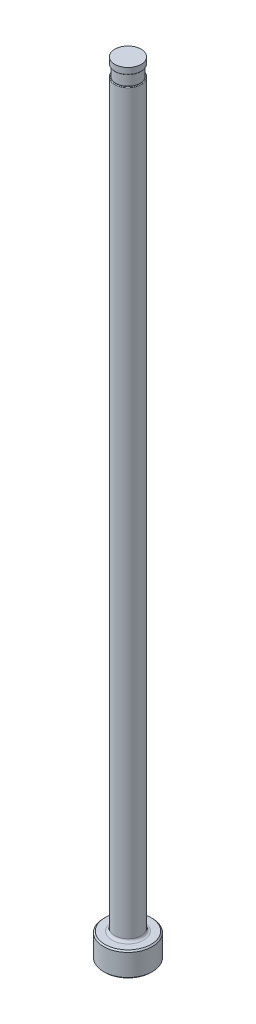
ISO-10303-21;
HEADER;
FILE_DESCRIPTION(('STEP AP214'),'2;1');
FILE_NAME('part.step','',(''),(''),'','','');
FILE_SCHEMA(('AUTOMOTIVE_DESIGN { 1 0 10303 214 1 1 1 1 }'));
ENDSEC;
DATA;
#1=APPLICATION_CONTEXT('core data for automotive mechanical design processes');
#2=APPLICATION_PROTOCOL_DEFINITION('international standard','automotive_design',2000,#1);
#3=PRODUCT_CONTEXT('',#1,'mechanical');
#4=PRODUCT('Part','Part','',(#3));
#5=PRODUCT_RELATED_PRODUCT_CATEGORY('part','',(#4));
#6=PRODUCT_DEFINITION_FORMATION('','',#4);
#7=PRODUCT_DEFINITION_CONTEXT('part definition',#1,'design');
#8=PRODUCT_DEFINITION('design','',#6,#7);
#9=PRODUCT_DEFINITION_SHAPE('','',#8);
#10=(LENGTH_UNIT() NAMED_UNIT(*) SI_UNIT(.MILLI.,.METRE.));
#11=(NAMED_UNIT(*) PLANE_ANGLE_UNIT() SI_UNIT($,.RADIAN.));
#12=(NAMED_UNIT(*) SI_UNIT($,.STERADIAN.) SOLID_ANGLE_UNIT());
#13=UNCERTAINTY_MEASURE_WITH_UNIT(LENGTH_MEASURE(1.E-05),#10,'distance_accuracy_value','');
#14=(GEOMETRIC_REPRESENTATION_CONTEXT(3) GLOBAL_UNCERTAINTY_ASSIGNED_CONTEXT((#13)) GLOBAL_UNIT_ASSIGNED_CONTEXT((#10,
#11,#12)) REPRESENTATION_CONTEXT('',''));
#15=CARTESIAN_POINT('',(0.,0.,0.));
#16=DIRECTION('',(0.,0.,1.));
#17=DIRECTION('',(1.,0.,0.));
#18=AXIS2_PLACEMENT_3D('',#15,#16,#17);
#19=CARTESIAN_POINT('',(-2.57936999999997,151.13,0.));
#20=DIRECTION('',(0.,1.,0.));
#21=DIRECTION('',(0.,0.,1.));
#22=AXIS2_PLACEMENT_3D('',#19,#20,#21);
#23=PLANE('',#22);
#24=CARTESIAN_POINT('',(0.,151.13,0.));
#25=DIRECTION('',(0.,1.,0.));
#26=DIRECTION('',(0.,0.,1.));
#27=AXIS2_PLACEMENT_3D('',#24,#25,#26);
#28=CIRCLE('',#27,2.43966999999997);
#29=CARTESIAN_POINT('',(0.,151.13,2.43966999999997));
#30=VERTEX_POINT('',#29);
#31=EDGE_CURVE('E11',#30,#30,#28,.F.);
#32=ORIENTED_EDGE('',*,*,#31,.T.);
#33=EDGE_LOOP('',(#32));
#34=FACE_BOUND('',#33,.T.);
#35=CARTESIAN_POINT('',(0.,151.13,0.));
#36=DIRECTION('',(0.,1.,0.));
#37=DIRECTION('',(0.,0.,1.));
#38=AXIS2_PLACEMENT_3D('',#35,#36,#37);
#39=CIRCLE('',#38,2.37616999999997);
#40=CARTESIAN_POINT('',(0.,151.13,2.37616999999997));
#41=VERTEX_POINT('',#40);
#42=EDGE_CURVE('E78',#41,#41,#39,.T.);
#43=ORIENTED_EDGE('',*,*,#42,.T.);
#44=EDGE_LOOP('',(#43));
#45=FACE_BOUND('',#44,.T.);
#46=ADVANCED_FACE('F36',(#34,#45),#23,.F.);
#47=CARTESIAN_POINT('',(0.,259.958771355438,0.));
#48=DIRECTION('',(0.,1.,0.));
#49=DIRECTION('',(0.,0.,1.));
#50=AXIS2_PLACEMENT_3D('',#47,#48,#49);
#51=CYLINDRICAL_SURFACE('',#50,2.57936999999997);
#52=DIRECTION('',(0.,1.,0.));
#53=VECTOR('',#52,1.);
#54=CARTESIAN_POINT('',(-2.37616999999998,259.958771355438,-1.00347681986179));
#55=LINE('',#54,#53);
#56=CARTESIAN_POINT('',(-2.37616999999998,148.971,-1.00347681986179));
#57=VERTEX_POINT('',#56);
#58=CARTESIAN_POINT('',(-2.37616999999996,86.614,-1.00347681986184));
#59=VERTEX_POINT('',#58);
#60=EDGE_CURVE('E73',#57,#59,#55,.F.);
#61=ORIENTED_EDGE('',*,*,#60,.F.);
#62=CARTESIAN_POINT('',(0.,148.971,0.));
#63=DIRECTION('',(0.,-1.,0.));
#64=DIRECTION('',(0.,0.,-1.));
#65=AXIS2_PLACEMENT_3D('',#62,#63,#64);
#66=CIRCLE('',#65,2.57936999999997);
#67=CARTESIAN_POINT('',(-2.37616999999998,148.971,1.00347681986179));
#68=VERTEX_POINT('',#67);
#69=EDGE_CURVE('E51',#57,#68,#66,.T.);
#70=ORIENTED_EDGE('',*,*,#69,.T.);
#71=DIRECTION('',(0.,1.,0.));
#72=VECTOR('',#71,1.);
#73=CARTESIAN_POINT('',(-2.37616999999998,259.958771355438,1.00347681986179));
#74=LINE('',#73,#72);
#75=CARTESIAN_POINT('',(-2.37616999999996,86.614,1.00347681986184));
#76=VERTEX_POINT('',#75);
#77=EDGE_CURVE('E84',#76,#68,#74,.T.);
#78=ORIENTED_EDGE('',*,*,#77,.F.);
#79=CARTESIAN_POINT('',(-2.37616999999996,86.614,-1.00347681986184));
#80=CARTESIAN_POINT('',(-2.3761678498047,86.5806535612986,-1.00347324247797));
#81=CARTESIAN_POINT('',(-2.37669600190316,86.547321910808,-1.00223238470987));
#82=CARTESIAN_POINT('',(-2.37878830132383,86.4808712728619,-0.997259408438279));
#83=CARTESIAN_POINT('',(-2.3803526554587,86.4477523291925,-0.993526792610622));
#84=CARTESIAN_POINT('',(-2.38657174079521,86.348866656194,-0.97854537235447));
#85=CARTESIAN_POINT('',(-2.39275229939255,86.2837173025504,-0.963512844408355));
#86=CARTESIAN_POINT('',(-2.40858326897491,86.1569814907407,-0.923223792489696));
#87=CARTESIAN_POINT('',(-2.41823988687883,86.0954016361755,-0.897948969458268));
#88=CARTESIAN_POINT('',(-2.4399460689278,85.9780247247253,-0.837167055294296));
#89=CARTESIAN_POINT('',(-2.45199238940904,85.9222199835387,-0.801673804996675));
#90=CARTESIAN_POINT('',(-2.47634550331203,85.8211237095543,-0.722822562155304));
#91=CARTESIAN_POINT('',(-2.48860868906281,85.7754444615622,-0.679950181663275));
#92=CARTESIAN_POINT('',(-2.51236371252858,85.6930631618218,-0.586096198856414));
#93=CARTESIAN_POINT('',(-2.52385591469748,85.6563568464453,-0.53511846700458));
#94=CARTESIAN_POINT('',(-2.54336333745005,85.5968448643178,-0.432311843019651));
#95=CARTESIAN_POINT('',(-2.55161740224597,85.5729816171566,-0.381139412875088));
#96=CARTESIAN_POINT('',(-2.56521925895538,85.5345821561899,-0.275047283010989));
#97=CARTESIAN_POINT('',(-2.5705685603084,85.5200410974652,-0.220129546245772));
#98=CARTESIAN_POINT('',(-2.57742936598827,85.5015339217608,-0.112636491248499));
#99=CARTESIAN_POINT('',(-2.57920175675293,85.4968477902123,-0.0602005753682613));
#100=CARTESIAN_POINT('',(-2.57951508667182,85.496013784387,0.0447435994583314));
#101=CARTESIAN_POINT('',(-2.57805674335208,85.4998640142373,0.0972518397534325));
#102=CARTESIAN_POINT('',(-2.57214487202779,85.515773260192,0.199435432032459));
#103=CARTESIAN_POINT('',(-2.56776943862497,85.5276183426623,0.249148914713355));
#104=CARTESIAN_POINT('',(-2.55654798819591,85.5589461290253,0.345804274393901));
#105=CARTESIAN_POINT('',(-2.54970197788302,85.5784288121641,0.392746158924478));
#106=CARTESIAN_POINT('',(-2.53407309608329,85.62487953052,0.483513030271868));
#107=CARTESIAN_POINT('',(-2.52525719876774,85.6519775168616,0.527265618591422));
#108=CARTESIAN_POINT('',(-2.5066235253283,85.7126856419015,0.609736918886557));
#109=CARTESIAN_POINT('',(-2.49680555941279,85.7462970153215,0.648454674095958));
#110=CARTESIAN_POINT('',(-2.47647062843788,85.8212568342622,0.722358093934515));
#111=CARTESIAN_POINT('',(-2.46594700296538,85.8629479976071,0.757193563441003));
#112=CARTESIAN_POINT('',(-2.44575759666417,85.951357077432,0.820068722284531));
#113=CARTESIAN_POINT('',(-2.43609222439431,85.9980773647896,0.848105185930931));
#114=CARTESIAN_POINT('',(-2.41760539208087,86.0998831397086,0.899528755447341));
#115=CARTESIAN_POINT('',(-2.40894797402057,86.1553422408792,0.922233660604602));
#116=CARTESIAN_POINT('',(-2.39441308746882,86.269312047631,0.959340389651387));
#117=CARTESIAN_POINT('',(-2.3885356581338,86.3278227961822,0.973742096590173));
#118=CARTESIAN_POINT('',(-2.38160417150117,86.4245543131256,0.990534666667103));
#119=CARTESIAN_POINT('',(-2.37957064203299,86.4622987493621,0.995396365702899));
#120=CARTESIAN_POINT('',(-2.37685226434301,86.5380255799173,1.00186164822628));
#121=CARTESIAN_POINT('',(-2.3761642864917,86.5760072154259,1.00347279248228));
#122=CARTESIAN_POINT('',(-2.37616999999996,86.614,1.00347681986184));
#123=B_SPLINE_CURVE_WITH_KNOTS('',3,(#79,#80,#81,#82,#83,#84,#85,#86,#87,#88,#89,#90,#91,#92,
#93,#94,#95,#96,#97,#98,#99,#100,#101,#102,#103,#104,#105,#106,#107,#108,#109,#110,#111,#112,
#113,#114,#115,#116,#117,#118,#119,#120,#121,#122),.UNSPECIFIED.,.F.,.F.,(4,2,2,2,2,2,2,2,2,2,2,
2,2,2,2,2,2,2,2,2,2,4),(0.,0.099982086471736,0.199984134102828,0.400421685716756,
0.601218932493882,0.80174546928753,0.992181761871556,1.18252738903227,1.35280353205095,
1.52299110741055,1.68023815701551,1.83745028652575,1.99061412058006,2.14377753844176,
2.29973239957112,2.45571685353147,2.62103910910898,2.78643964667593,2.96734496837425,
3.14825283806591,3.26243374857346,3.37634876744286),.UNSPECIFIED.);
#124=EDGE_CURVE('E81',#59,#76,#123,.T.);
#125=ORIENTED_EDGE('',*,*,#124,.F.);
#126=EDGE_LOOP('',(#61,#70,#78,#125));
#127=FACE_BOUND('',#126,.T.);
#128=CARTESIAN_POINT('',(0.,5.25779999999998,0.));
#129=DIRECTION('',(0.,1.,0.));
#130=DIRECTION('',(0.,0.,1.));
#131=AXIS2_PLACEMENT_3D('',#128,#129,#130);
#132=CIRCLE('',#131,2.57936999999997);
#133=CARTESIAN_POINT('',(0.,5.25779999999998,2.57936999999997));
#134=VERTEX_POINT('',#133);
#135=EDGE_CURVE('E116',#134,#134,#132,.T.);
#136=ORIENTED_EDGE('',*,*,#135,.T.);
#137=EDGE_LOOP('',(#136));
#138=FACE_BOUND('',#137,.T.);
#139=ADVANCED_FACE('F82',(#127,#138),#51,.T.);
#140=CARTESIAN_POINT('',(0.,0.,0.));
#141=DIRECTION('',(0.,-1.,0.));
#142=DIRECTION('',(0.,0.,-1.));
#143=AXIS2_PLACEMENT_3D('',#140,#141,#142);
#144=PLANE('',#143);
#145=CARTESIAN_POINT('',(0.,0.,0.));
#146=DIRECTION('',(0.,-1.,0.));
#147=DIRECTION('',(0.,0.,-1.));
#148=AXIS2_PLACEMENT_3D('',#145,#146,#147);
#149=CIRCLE('',#148,4.50849999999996);
#150=CARTESIAN_POINT('',(0.,0.,-4.50849999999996));
#151=VERTEX_POINT('',#150);
#152=EDGE_CURVE('E113',#151,#151,#149,.T.);
#153=ORIENTED_EDGE('',*,*,#152,.T.);
#154=EDGE_LOOP('',(#153));
#155=FACE_BOUND('',#154,.T.);
#156=ADVANCED_FACE('F192',(#155),#144,.T.);
#157=CARTESIAN_POINT('',(0.,259.958771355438,0.));
#158=DIRECTION('',(0.,1.,0.));
#159=DIRECTION('',(0.,0.,1.));
#160=AXIS2_PLACEMENT_3D('',#157,#158,#159);
#161=CYLINDRICAL_SURFACE('',#160,4.76249999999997);
#162=CARTESIAN_POINT('',(0.,4.49579999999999,0.));
#163=DIRECTION('',(0.,1.,0.));
#164=DIRECTION('',(0.,0.,1.));
#165=AXIS2_PLACEMENT_3D('',#162,#163,#164);
#166=CIRCLE('',#165,4.76249999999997);
#167=CARTESIAN_POINT('',(0.,4.49579999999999,4.76249999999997));
#168=VERTEX_POINT('',#167);
#169=EDGE_CURVE('E110',#168,#168,#166,.F.);
#170=ORIENTED_EDGE('',*,*,#169,.T.);
#171=EDGE_LOOP('',(#170));
#172=FACE_BOUND('',#171,.T.);
#173=CARTESIAN_POINT('',(0.,0.254000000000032,0.));
#174=DIRECTION('',(0.,-1.,0.));
#175=DIRECTION('',(0.,0.,-1.));
#176=AXIS2_PLACEMENT_3D('',#173,#174,#175);
#177=CIRCLE('',#176,4.76249999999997);
#178=CARTESIAN_POINT('',(0.,0.254000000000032,-4.76249999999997));
#179=VERTEX_POINT('',#178);
#180=EDGE_CURVE('E107',#179,#179,#177,.F.);
#181=ORIENTED_EDGE('',*,*,#180,.T.);
#182=EDGE_LOOP('',(#181));
#183=FACE_BOUND('',#182,.T.);
#184=ADVANCED_FACE('F195',(#172,#183),#161,.T.);
#185=CARTESIAN_POINT('',(-4.76249999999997,4.7498,0.));
#186=DIRECTION('',(0.,1.,0.));
#187=DIRECTION('',(0.,0.,1.));
#188=AXIS2_PLACEMENT_3D('',#185,#186,#187);
#189=PLANE('',#188);
#190=CARTESIAN_POINT('',(0.,4.7498,0.));
#191=DIRECTION('',(0.,1.,0.));
#192=DIRECTION('',(0.,0.,1.));
#193=AXIS2_PLACEMENT_3D('',#190,#191,#192);
#194=CIRCLE('',#193,3.08736999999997);
#195=CARTESIAN_POINT('',(0.,4.7498,3.08736999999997));
#196=VERTEX_POINT('',#195);
#197=EDGE_CURVE('E87',#196,#196,#194,.F.);
#198=ORIENTED_EDGE('',*,*,#197,.T.);
#199=EDGE_LOOP('',(#198));
#200=FACE_BOUND('',#199,.T.);
#201=CARTESIAN_POINT('',(0.,4.7498,0.));
#202=DIRECTION('',(0.,1.,0.));
#203=DIRECTION('',(0.,0.,1.));
#204=AXIS2_PLACEMENT_3D('',#201,#202,#203);
#205=CIRCLE('',#204,4.50849999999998);
#206=CARTESIAN_POINT('',(0.,4.7498,4.50849999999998));
#207=VERTEX_POINT('',#206);
#208=EDGE_CURVE('E104',#207,#207,#205,.T.);
#209=ORIENTED_EDGE('',*,*,#208,.T.);
#210=EDGE_LOOP('',(#209));
#211=FACE_BOUND('',#210,.T.);
#212=ADVANCED_FACE('F190',(#200,#211),#189,.T.);
#213=CARTESIAN_POINT('',(0.,4.74980000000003,0.));
#214=DIRECTION('',(0.,-1.,0.));
#215=DIRECTION('',(0.,0.,-1.));
#216=AXIS2_PLACEMENT_3D('',#213,#214,#215);
#217=CONICAL_SURFACE('',#216,4.50849999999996,0.785398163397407);
#218=ORIENTED_EDGE('',*,*,#169,.F.);
#219=EDGE_LOOP('',(#218));
#220=FACE_BOUND('',#219,.T.);
#221=ORIENTED_EDGE('',*,*,#208,.F.);
#222=EDGE_LOOP('',(#221));
#223=FACE_BOUND('',#222,.T.);
#224=ADVANCED_FACE('F186',(#220,#223),#217,.T.);
#225=CARTESIAN_POINT('',(0.,0.254000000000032,0.));
#226=DIRECTION('',(0.,1.,0.));
#227=DIRECTION('',(0.,0.,1.));
#228=AXIS2_PLACEMENT_3D('',#225,#226,#227);
#229=CONICAL_SURFACE('',#228,4.76249999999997,0.785398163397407);
#230=ORIENTED_EDGE('',*,*,#152,.F.);
#231=EDGE_LOOP('',(#230));
#232=FACE_BOUND('',#231,.T.);
#233=ORIENTED_EDGE('',*,*,#180,.F.);
#234=EDGE_LOOP('',(#233));
#235=FACE_BOUND('',#234,.T.);
#236=ADVANCED_FACE('F182',(#232,#235),#229,.T.);
#237=CARTESIAN_POINT('',(0.,5.25779999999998,0.));
#238=DIRECTION('',(0.,1.,0.));
#239=DIRECTION('',(0.,0.,1.));
#240=AXIS2_PLACEMENT_3D('',#237,#238,#239);
#241=TOROIDAL_SURFACE('',#240,3.08736999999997,0.508);
#242=ORIENTED_EDGE('',*,*,#197,.F.);
#243=EDGE_LOOP('',(#242));
#244=FACE_BOUND('',#243,.T.);
#245=ORIENTED_EDGE('',*,*,#135,.F.);
#246=EDGE_LOOP('',(#245));
#247=FACE_BOUND('',#246,.T.);
#248=ADVANCED_FACE('F147',(#244,#247),#241,.F.);
#249=CARTESIAN_POINT('',(-2.57936999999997,149.098,0.));
#250=DIRECTION('',(0.,-1.,0.));
#251=DIRECTION('',(0.,0.,-1.));
#252=AXIS2_PLACEMENT_3D('',#249,#250,#251);
#253=PLANE('',#252);
#254=DIRECTION('',(0.,0.,1.));
#255=VECTOR('',#254,1.);
#256=CARTESIAN_POINT('',(-2.37616999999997,149.098,0.));
#257=LINE('',#256,#255);
#258=CARTESIAN_POINT('',(-2.37616999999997,149.098,0.));
#259=VERTEX_POINT('',#258);
#260=CARTESIAN_POINT('',(-2.37616999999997,149.098,0.60657625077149));
#261=VERTEX_POINT('',#260);
#262=EDGE_CURVE('E90',#259,#261,#257,.T.);
#263=ORIENTED_EDGE('',*,*,#262,.T.);
#264=CARTESIAN_POINT('',(0.,149.098,0.));
#265=DIRECTION('',(0.,-1.,0.));
#266=DIRECTION('',(0.,0.,-1.));
#267=AXIS2_PLACEMENT_3D('',#264,#265,#266);
#268=CIRCLE('',#267,2.45236999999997);
#269=CARTESIAN_POINT('',(-2.37616999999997,149.098,-0.60657625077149));
#270=VERTEX_POINT('',#269);
#271=EDGE_CURVE('E86',#261,#270,#268,.F.);
#272=ORIENTED_EDGE('',*,*,#271,.T.);
#273=EDGE_CURVE('E79',#270,#259,#257,.T.);
#274=ORIENTED_EDGE('',*,*,#273,.T.);
#275=CARTESIAN_POINT('',(0.,149.098,0.));
#276=DIRECTION('',(0.,1.,0.));
#277=DIRECTION('',(0.,0.,1.));
#278=AXIS2_PLACEMENT_3D('',#275,#276,#277);
#279=CIRCLE('',#278,2.37616999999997);
#280=EDGE_CURVE('E101',#259,#259,#279,.T.);
#281=ORIENTED_EDGE('',*,*,#280,.F.);
#282=EDGE_LOOP('',(#263,#272,#274,#281));
#283=FACE_BOUND('',#282,.T.);
#284=ADVANCED_FACE('F144',(#283),#253,.F.);
#285=CARTESIAN_POINT('',(0.,153.448281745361,0.));
#286=DIRECTION('',(0.,1.,0.));
#287=DIRECTION('',(0.,0.,1.));
#288=AXIS2_PLACEMENT_3D('',#285,#286,#287);
#289=CYLINDRICAL_SURFACE('',#288,2.37616999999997);
#290=ORIENTED_EDGE('',*,*,#42,.F.);
#291=EDGE_LOOP('',(#290));
#292=FACE_BOUND('',#291,.T.);
#293=ORIENTED_EDGE('',*,*,#280,.T.);
#294=EDGE_LOOP('',(#293));
#295=FACE_BOUND('',#294,.T.);
#296=ADVANCED_FACE('F141',(#292,#295),#289,.T.);
#297=CARTESIAN_POINT('',(-2.37616999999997,150.114,-4.76249999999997));
#298=DIRECTION('',(1.,0.,0.));
#299=DIRECTION('',(0.,1.,0.));
#300=AXIS2_PLACEMENT_3D('',#297,#298,#299);
#301=PLANE('',#300);
#302=ORIENTED_EDGE('',*,*,#273,.F.);
#303=CARTESIAN_POINT('',(-2.37616999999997,149.098,-0.60657625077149));
#304=CARTESIAN_POINT('',(-2.37616999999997,149.097986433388,-0.627774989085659));
#305=CARTESIAN_POINT('',(-2.37616999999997,149.097673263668,-0.648986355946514));
#306=CARTESIAN_POINT('',(-2.37616999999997,149.096169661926,-0.691484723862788));
#307=CARTESIAN_POINT('',(-2.37616999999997,149.094974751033,-0.712771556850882));
#308=CARTESIAN_POINT('',(-2.37616999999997,149.091417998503,-0.755326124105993));
#309=CARTESIAN_POINT('',(-2.37616999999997,149.089052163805,-0.776593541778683));
#310=CARTESIAN_POINT('',(-2.37616999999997,149.082718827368,-0.818863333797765));
#311=CARTESIAN_POINT('',(-2.37616999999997,149.078755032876,-0.839866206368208));
#312=CARTESIAN_POINT('',(-2.37616999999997,149.071365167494,-0.869601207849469));
#313=CARTESIAN_POINT('',(-2.37616999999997,149.068897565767,-0.878570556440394));
#314=CARTESIAN_POINT('',(-2.37616999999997,149.063395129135,-0.896363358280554));
#315=CARTESIAN_POINT('',(-2.37616999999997,149.060358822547,-0.905186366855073));
#316=CARTESIAN_POINT('',(-2.37616999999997,149.053046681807,-0.923923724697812));
#317=CARTESIAN_POINT('',(-2.37616999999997,149.048651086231,-0.933791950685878));
#318=CARTESIAN_POINT('',(-2.37616999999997,149.038570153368,-0.952838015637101));
#319=CARTESIAN_POINT('',(-2.37616999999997,149.032891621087,-0.962019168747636));
#320=CARTESIAN_POINT('',(-2.37616999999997,149.023665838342,-0.973806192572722));
#321=CARTESIAN_POINT('',(-2.37616999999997,149.020910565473,-0.977026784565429));
#322=CARTESIAN_POINT('',(-2.37616999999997,149.015048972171,-0.983149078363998));
#323=CARTESIAN_POINT('',(-2.37616999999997,149.011942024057,-0.986050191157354));
#324=CARTESIAN_POINT('',(-2.37616999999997,149.005290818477,-0.991423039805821));
#325=CARTESIAN_POINT('',(-2.37616999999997,149.001740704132,-0.993887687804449));
#326=CARTESIAN_POINT('',(-2.37616999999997,148.994248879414,-0.998099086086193));
#327=CARTESIAN_POINT('',(-2.37616999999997,148.9903097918,-0.999850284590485));
#328=CARTESIAN_POINT('',(-2.37616999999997,148.983771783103,-1.00188288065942));
#329=CARTESIAN_POINT('',(-2.37616999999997,148.981268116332,-1.00247204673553));
#330=CARTESIAN_POINT('',(-2.37616999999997,148.976178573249,-1.00327288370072));
#331=CARTESIAN_POINT('',(-2.37616999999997,148.973592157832,-1.00348108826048));
#332=CARTESIAN_POINT('',(-2.37616999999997,148.971,-1.00347681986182));
#333=B_SPLINE_CURVE_WITH_KNOTS('',3,(#303,#304,#305,#306,#307,#308,#309,#310,#311,#312,#313,
#314,#315,#316,#317,#318,#319,#320,#321,#322,#323,#324,#325,#326,#327,#328,#329,#330,#331,#332),
.UNSPECIFIED.,.F.,.F.,(4,2,2,2,2,2,2,2,2,2,2,2,2,2,4),(0.,0.0636141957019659,0.127553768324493,
0.191712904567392,0.255724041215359,0.283618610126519,0.311586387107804,0.343944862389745,
0.376135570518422,0.388831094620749,0.401549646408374,0.414458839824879,0.427286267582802,
0.434975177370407,0.442733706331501),.UNSPECIFIED.);
#334=EDGE_CURVE('E59',#270,#57,#333,.T.);
#335=ORIENTED_EDGE('',*,*,#334,.T.);
#336=ORIENTED_EDGE('',*,*,#60,.T.);
#337=DIRECTION('',(0.,0.,1.));
#338=VECTOR('',#337,1.);
#339=CARTESIAN_POINT('',(-2.37616999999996,86.614,-4.76249999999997));
#340=LINE('',#339,#338);
#341=EDGE_CURVE('E77',#59,#76,#340,.T.);
#342=ORIENTED_EDGE('',*,*,#341,.T.);
#343=ORIENTED_EDGE('',*,*,#77,.T.);
#344=CARTESIAN_POINT('',(-2.37616999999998,148.971,1.00347681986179));
#345=CARTESIAN_POINT('',(-2.37616999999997,148.97408677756,1.00348533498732));
#346=CARTESIAN_POINT('',(-2.37616999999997,148.977162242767,1.00318798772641));
#347=CARTESIAN_POINT('',(-2.37616999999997,148.983176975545,1.00206106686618));
#348=CARTESIAN_POINT('',(-2.37616999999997,148.986117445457,1.00123801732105));
#349=CARTESIAN_POINT('',(-2.37616999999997,148.992507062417,0.998885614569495));
#350=CARTESIAN_POINT('',(-2.37616999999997,148.995910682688,0.997234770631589));
#351=CARTESIAN_POINT('',(-2.37616999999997,149.002418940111,0.993404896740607));
#352=CARTESIAN_POINT('',(-2.37616999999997,149.005521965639,0.991223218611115));
#353=CARTESIAN_POINT('',(-2.37616999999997,149.013245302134,0.985017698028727));
#354=CARTESIAN_POINT('',(-2.37616999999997,149.01761779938,0.980688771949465));
#355=CARTESIAN_POINT('',(-2.37616999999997,149.025686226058,0.971452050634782));
#356=CARTESIAN_POINT('',(-2.37616999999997,149.029380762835,0.966543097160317));
#357=CARTESIAN_POINT('',(-2.37616999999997,149.039861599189,0.950989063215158));
#358=CARTESIAN_POINT('',(-2.37616999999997,149.045783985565,0.939769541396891));
#359=CARTESIAN_POINT('',(-2.37616999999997,149.056142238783,0.916677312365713));
#360=CARTESIAN_POINT('',(-2.37616999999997,149.060573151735,0.904802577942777));
#361=CARTESIAN_POINT('',(-2.37616999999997,149.070828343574,0.873126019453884));
#362=CARTESIAN_POINT('',(-2.37616999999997,149.075772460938,0.853042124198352));
#363=CARTESIAN_POINT('',(-2.37616999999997,149.083834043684,0.812501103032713));
#364=CARTESIAN_POINT('',(-2.37616999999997,149.086947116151,0.792043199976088));
#365=CARTESIAN_POINT('',(-2.37616999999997,149.094347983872,0.730361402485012));
#366=CARTESIAN_POINT('',(-2.37616999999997,149.096678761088,0.688903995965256));
#367=CARTESIAN_POINT('',(-2.37616999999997,149.097717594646,0.640645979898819));
#368=CARTESIAN_POINT('',(-2.37616999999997,149.0978254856,0.633819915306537));
#369=CARTESIAN_POINT('',(-2.37616999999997,149.097967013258,0.620188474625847));
#370=CARTESIAN_POINT('',(-2.37616999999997,149.098000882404,0.613383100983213));
#371=CARTESIAN_POINT('',(-2.37616999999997,149.098,0.606576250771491));
#372=B_SPLINE_CURVE_WITH_KNOTS('',3,(#344,#345,#346,#347,#348,#349,#350,#351,#352,#353,#354,
#355,#356,#357,#358,#359,#360,#361,#362,#363,#364,#365,#366,#367,#368,#369,#370,#371),
.UNSPECIFIED.,.F.,.F.,(4,2,2,2,2,2,2,2,2,2,2,2,2,4),(0.,0.00922779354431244,0.0183432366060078,
0.0296284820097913,0.0409712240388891,0.0593256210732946,0.0777173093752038,0.115565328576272,
0.153537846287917,0.215427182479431,0.277464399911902,0.401767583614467,0.422249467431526,
0.44266694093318),.UNSPECIFIED.);
#373=EDGE_CURVE('E172',#68,#261,#372,.T.);
#374=ORIENTED_EDGE('',*,*,#373,.T.);
#375=ORIENTED_EDGE('',*,*,#262,.F.);
#376=EDGE_LOOP('',(#302,#335,#336,#342,#343,#374,#375));
#377=FACE_BOUND('',#376,.T.);
#378=ADVANCED_FACE('F75',(#377),#301,.F.);
#379=CARTESIAN_POINT('',(-5.55116999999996,86.614,-4.76249999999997));
#380=DIRECTION('',(0.,0.,1.));
#381=DIRECTION('',(1.,0.,0.));
#382=AXIS2_PLACEMENT_3D('',#379,#380,#381);
#383=CYLINDRICAL_SURFACE('',#382,3.175);
#384=ORIENTED_EDGE('',*,*,#341,.F.);
#385=ORIENTED_EDGE('',*,*,#124,.T.);
#386=EDGE_LOOP('',(#384,#385));
#387=FACE_BOUND('',#386,.T.);
#388=ADVANCED_FACE('F89',(#387),#383,.F.);
#389=CARTESIAN_POINT('',(0.,152.687735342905,0.));
#390=DIRECTION('',(0.,1.,0.));
#391=DIRECTION('',(0.,0.,1.));
#392=AXIS2_PLACEMENT_3D('',#389,#390,#391);
#393=CYLINDRICAL_SURFACE('',#392,2.56666999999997);
#394=CARTESIAN_POINT('',(0.,151.257,0.));
#395=DIRECTION('',(0.,1.,0.));
#396=DIRECTION('',(0.,0.,1.));
#397=AXIS2_PLACEMENT_3D('',#394,#395,#396);
#398=CIRCLE('',#397,2.56666999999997);
#399=CARTESIAN_POINT('',(0.,151.257,2.56666999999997));
#400=VERTEX_POINT('',#399);
#401=EDGE_CURVE('E44',#400,#400,#398,.T.);
#402=ORIENTED_EDGE('',*,*,#401,.T.);
#403=EDGE_LOOP('',(#402));
#404=FACE_BOUND('',#403,.T.);
#405=CARTESIAN_POINT('',(0.,152.4,0.));
#406=DIRECTION('',(0.,1.,0.));
#407=DIRECTION('',(0.,0.,1.));
#408=AXIS2_PLACEMENT_3D('',#405,#406,#407);
#409=CIRCLE('',#408,2.56666999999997);
#410=CARTESIAN_POINT('',(0.,152.4,2.56666999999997));
#411=VERTEX_POINT('',#410);
#412=EDGE_CURVE('E91',#411,#411,#409,.T.);
#413=ORIENTED_EDGE('',*,*,#412,.F.);
#414=EDGE_LOOP('',(#413));
#415=FACE_BOUND('',#414,.T.);
#416=ADVANCED_FACE('F135',(#404,#415),#393,.T.);
#417=CARTESIAN_POINT('',(-2.57936999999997,152.4,0.));
#418=DIRECTION('',(0.,1.,0.));
#419=DIRECTION('',(0.,0.,1.));
#420=AXIS2_PLACEMENT_3D('',#417,#418,#419);
#421=PLANE('',#420);
#422=ORIENTED_EDGE('',*,*,#412,.T.);
#423=EDGE_LOOP('',(#422));
#424=FACE_BOUND('',#423,.T.);
#425=ADVANCED_FACE('F149',(#424),#421,.T.);
#426=CARTESIAN_POINT('',(0.,148.971,0.));
#427=DIRECTION('',(0.,-1.,0.));
#428=DIRECTION('',(0.,0.,-1.));
#429=AXIS2_PLACEMENT_3D('',#426,#427,#428);
#430=TOROIDAL_SURFACE('',#429,2.45236999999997,0.127);
#431=ORIENTED_EDGE('',*,*,#373,.F.);
#432=ORIENTED_EDGE('',*,*,#69,.F.);
#433=ORIENTED_EDGE('',*,*,#334,.F.);
#434=ORIENTED_EDGE('',*,*,#271,.F.);
#435=EDGE_LOOP('',(#431,#432,#433,#434));
#436=FACE_BOUND('',#435,.T.);
#437=ADVANCED_FACE('F151',(#436),#430,.T.);
#438=CARTESIAN_POINT('',(0.,151.257,0.));
#439=DIRECTION('',(0.,1.,0.));
#440=DIRECTION('',(0.,0.,1.));
#441=AXIS2_PLACEMENT_3D('',#438,#439,#440);
#442=TOROIDAL_SURFACE('',#441,2.43966999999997,0.127);
#443=ORIENTED_EDGE('',*,*,#31,.F.);
#444=EDGE_LOOP('',(#443));
#445=FACE_BOUND('',#444,.T.);
#446=ORIENTED_EDGE('',*,*,#401,.F.);
#447=EDGE_LOOP('',(#446));
#448=FACE_BOUND('',#447,.T.);
#449=ADVANCED_FACE('F38',(#445,#448),#442,.T.);
#450=CLOSED_SHELL('',(#46,#139,#156,#184,#212,#224,#236,#248,#284,#296,#378,#388,#416,#425,#437,#449));
#451=MANIFOLD_SOLID_BREP('B2',#450);
#452=ADVANCED_BREP_SHAPE_REPRESENTATION('',(#18,#451),#14);
#453=SHAPE_DEFINITION_REPRESENTATION(#9,#452);
ENDSEC;
END-ISO-10303-21;
